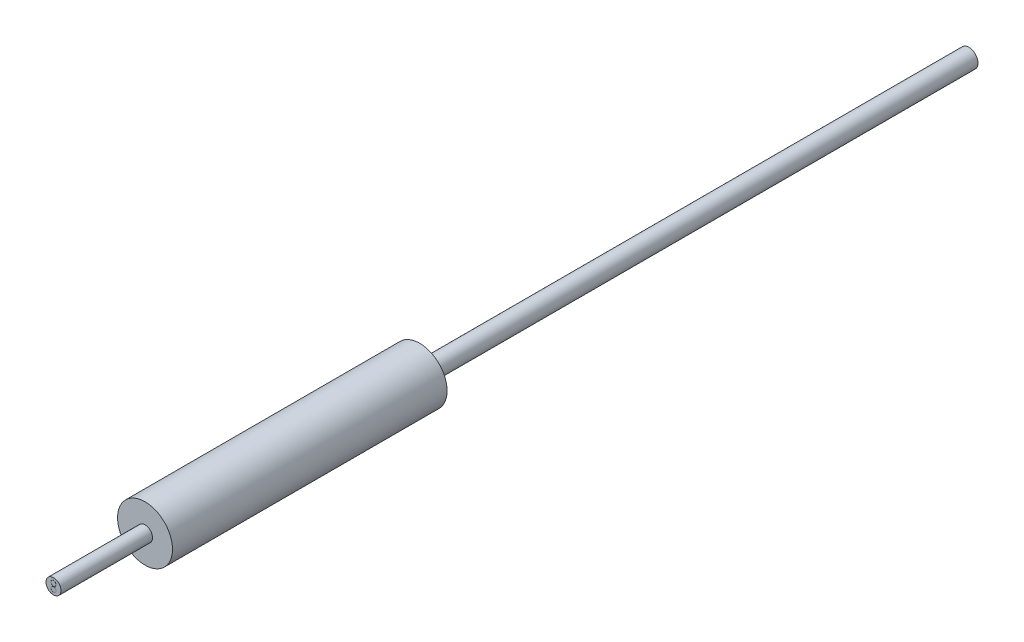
ISO-10303-21;
HEADER;
FILE_DESCRIPTION(('STEP AP214'),'2;1');
FILE_NAME('part.step','',(''),(''),'','','');
FILE_SCHEMA(('AUTOMOTIVE_DESIGN { 1 0 10303 214 1 1 1 1 }'));
ENDSEC;
DATA;
#1=APPLICATION_CONTEXT('core data for automotive mechanical design processes');
#2=APPLICATION_PROTOCOL_DEFINITION('international standard','automotive_design',2000,#1);
#3=PRODUCT_CONTEXT('',#1,'mechanical');
#4=PRODUCT('Part','Part','',(#3));
#5=PRODUCT_RELATED_PRODUCT_CATEGORY('part','',(#4));
#6=PRODUCT_DEFINITION_FORMATION('','',#4);
#7=PRODUCT_DEFINITION_CONTEXT('part definition',#1,'design');
#8=PRODUCT_DEFINITION('design','',#6,#7);
#9=PRODUCT_DEFINITION_SHAPE('','',#8);
#10=(LENGTH_UNIT() NAMED_UNIT(*) SI_UNIT(.MILLI.,.METRE.));
#11=(NAMED_UNIT(*) PLANE_ANGLE_UNIT() SI_UNIT($,.RADIAN.));
#12=(NAMED_UNIT(*) SI_UNIT($,.STERADIAN.) SOLID_ANGLE_UNIT());
#13=UNCERTAINTY_MEASURE_WITH_UNIT(LENGTH_MEASURE(1.E-05),#10,'distance_accuracy_value','');
#14=(GEOMETRIC_REPRESENTATION_CONTEXT(3) GLOBAL_UNCERTAINTY_ASSIGNED_CONTEXT((#13)) GLOBAL_UNIT_ASSIGNED_CONTEXT((#10,
#11,#12)) REPRESENTATION_CONTEXT('',''));
#15=CARTESIAN_POINT('',(0.,0.,0.));
#16=DIRECTION('',(0.,0.,1.));
#17=DIRECTION('',(1.,0.,0.));
#18=AXIS2_PLACEMENT_3D('',#15,#16,#17);
#19=CARTESIAN_POINT('',(0.,0.,-15.));
#20=DIRECTION('',(0.,0.,1.));
#21=DIRECTION('',(1.,0.,0.));
#22=AXIS2_PLACEMENT_3D('',#19,#20,#21);
#23=CYLINDRICAL_SURFACE('',#22,1.5);
#24=CARTESIAN_POINT('',(0.,0.,-15.));
#25=DIRECTION('',(0.,0.,1.));
#26=DIRECTION('',(1.,0.,0.));
#27=AXIS2_PLACEMENT_3D('',#24,#25,#26);
#28=CIRCLE('',#27,1.5);
#29=CARTESIAN_POINT('',(1.5,0.,-15.));
#30=VERTEX_POINT('',#29);
#31=EDGE_CURVE('E45',#30,#30,#28,.T.);
#32=ORIENTED_EDGE('',*,*,#31,.T.);
#33=EDGE_LOOP('',(#32));
#34=FACE_BOUND('',#33,.T.);
#35=CARTESIAN_POINT('',(0.,0.,0.));
#36=DIRECTION('',(0.,0.,1.));
#37=DIRECTION('',(1.,0.,0.));
#38=AXIS2_PLACEMENT_3D('',#35,#36,#37);
#39=CIRCLE('',#38,1.5);
#40=CARTESIAN_POINT('',(1.5,0.,0.));
#41=VERTEX_POINT('',#40);
#42=EDGE_CURVE('E36',#41,#41,#39,.T.);
#43=ORIENTED_EDGE('',*,*,#42,.F.);
#44=EDGE_LOOP('',(#43));
#45=FACE_BOUND('',#44,.T.);
#46=ADVANCED_FACE('F33',(#34,#45),#23,.T.);
#47=CARTESIAN_POINT('',(0.,0.,-15.));
#48=DIRECTION('',(0.,0.,1.));
#49=DIRECTION('',(1.,0.,0.));
#50=AXIS2_PLACEMENT_3D('',#47,#48,#49);
#51=PLANE('',#50);
#52=CARTESIAN_POINT('',(0.,0.,-15.));
#53=DIRECTION('',(0.,0.,-1.));
#54=DIRECTION('',(-1.,0.,0.));
#55=AXIS2_PLACEMENT_3D('',#52,#53,#54);
#56=CIRCLE('',#55,0.5);
#57=CARTESIAN_POINT('',(-0.5,0.,-15.));
#58=VERTEX_POINT('',#57);
#59=EDGE_CURVE('E40',#58,#58,#56,.T.);
#60=ORIENTED_EDGE('',*,*,#59,.F.);
#61=EDGE_LOOP('',(#60));
#62=FACE_BOUND('',#61,.T.);
#63=ORIENTED_EDGE('',*,*,#31,.F.);
#64=EDGE_LOOP('',(#63));
#65=FACE_BOUND('',#64,.T.);
#66=ADVANCED_FACE('F62',(#62,#65),#51,.F.);
#67=CARTESIAN_POINT('',(0.,0.,0.));
#68=DIRECTION('',(0.,0.,1.));
#69=DIRECTION('',(1.,0.,0.));
#70=AXIS2_PLACEMENT_3D('',#67,#68,#69);
#71=PLANE('',#70);
#72=CARTESIAN_POINT('',(0.,0.,0.));
#73=DIRECTION('',(0.,0.,1.));
#74=DIRECTION('',(1.,0.,0.));
#75=AXIS2_PLACEMENT_3D('',#72,#73,#74);
#76=CIRCLE('',#75,0.41);
#77=CARTESIAN_POINT('',(0.41,0.,0.));
#78=VERTEX_POINT('',#77);
#79=EDGE_CURVE('E10',#78,#78,#76,.T.);
#80=ORIENTED_EDGE('',*,*,#79,.F.);
#81=EDGE_LOOP('',(#80));
#82=FACE_BOUND('',#81,.T.);
#83=ORIENTED_EDGE('',*,*,#42,.T.);
#84=EDGE_LOOP('',(#83));
#85=FACE_BOUND('',#84,.T.);
#86=ADVANCED_FACE('F59',(#82,#85),#71,.T.);
#87=CARTESIAN_POINT('',(0.,0.,-45.));
#88=DIRECTION('',(0.,0.,1.));
#89=DIRECTION('',(1.,0.,0.));
#90=AXIS2_PLACEMENT_3D('',#87,#88,#89);
#91=CYLINDRICAL_SURFACE('',#90,0.5);
#92=CARTESIAN_POINT('',(0.,0.,-45.));
#93=DIRECTION('',(0.,0.,-1.));
#94=DIRECTION('',(-1.,0.,0.));
#95=AXIS2_PLACEMENT_3D('',#92,#93,#94);
#96=CIRCLE('',#95,0.5);
#97=CARTESIAN_POINT('',(-0.5,0.,-45.));
#98=VERTEX_POINT('',#97);
#99=EDGE_CURVE('E51',#98,#98,#96,.T.);
#100=ORIENTED_EDGE('',*,*,#99,.F.);
#101=EDGE_LOOP('',(#100));
#102=FACE_BOUND('',#101,.T.);
#103=ORIENTED_EDGE('',*,*,#59,.T.);
#104=EDGE_LOOP('',(#103));
#105=FACE_BOUND('',#104,.T.);
#106=ADVANCED_FACE('F71',(#102,#105),#91,.T.);
#107=CARTESIAN_POINT('',(0.,0.,-45.));
#108=DIRECTION('',(0.,0.,-1.));
#109=DIRECTION('',(-1.,0.,0.));
#110=AXIS2_PLACEMENT_3D('',#107,#108,#109);
#111=PLANE('',#110);
#112=ORIENTED_EDGE('',*,*,#99,.T.);
#113=EDGE_LOOP('',(#112));
#114=FACE_BOUND('',#113,.T.);
#115=ADVANCED_FACE('F78',(#114),#111,.T.);
#116=CARTESIAN_POINT('',(0.,0.,5.));
#117=DIRECTION('',(0.,0.,-1.));
#118=DIRECTION('',(-1.,0.,0.));
#119=AXIS2_PLACEMENT_3D('',#116,#117,#118);
#120=CYLINDRICAL_SURFACE('',#119,0.41);
#121=CARTESIAN_POINT('',(0.,0.,5.));
#122=DIRECTION('',(0.,0.,1.));
#123=DIRECTION('',(1.,0.,0.));
#124=AXIS2_PLACEMENT_3D('',#121,#122,#123);
#125=CIRCLE('',#124,0.41);
#126=CARTESIAN_POINT('',(0.41,0.,5.));
#127=VERTEX_POINT('',#126);
#128=EDGE_CURVE('E49',#127,#127,#125,.T.);
#129=ORIENTED_EDGE('',*,*,#128,.F.);
#130=EDGE_LOOP('',(#129));
#131=FACE_BOUND('',#130,.T.);
#132=ORIENTED_EDGE('',*,*,#79,.T.);
#133=EDGE_LOOP('',(#132));
#134=FACE_BOUND('',#133,.T.);
#135=ADVANCED_FACE('F82',(#131,#134),#120,.T.);
#136=CARTESIAN_POINT('',(0.,0.,5.));
#137=DIRECTION('',(0.,0.,1.));
#138=DIRECTION('',(1.,0.,0.));
#139=AXIS2_PLACEMENT_3D('',#136,#137,#138);
#140=PLANE('',#139);
#141=CARTESIAN_POINT('',(0.,-0.1475,5.));
#142=DIRECTION('',(0.,0.,1.));
#143=DIRECTION('',(1.,0.,0.));
#144=AXIS2_PLACEMENT_3D('',#141,#142,#143);
#145=CIRCLE('',#144,0.1375);
#146=CARTESIAN_POINT('',(0.1375,-0.1475,5.));
#147=VERTEX_POINT('',#146);
#148=EDGE_CURVE('E130',#147,#147,#145,.T.);
#149=ORIENTED_EDGE('',*,*,#148,.F.);
#150=EDGE_LOOP('',(#149));
#151=FACE_BOUND('',#150,.T.);
#152=CARTESIAN_POINT('',(0.,0.1475,5.));
#153=DIRECTION('',(0.,0.,1.));
#154=DIRECTION('',(1.,0.,0.));
#155=AXIS2_PLACEMENT_3D('',#152,#153,#154);
#156=CIRCLE('',#155,0.1375);
#157=CARTESIAN_POINT('',(0.1375,0.1475,5.));
#158=VERTEX_POINT('',#157);
#159=EDGE_CURVE('E133',#158,#158,#156,.T.);
#160=ORIENTED_EDGE('',*,*,#159,.F.);
#161=EDGE_LOOP('',(#160));
#162=FACE_BOUND('',#161,.T.);
#163=ORIENTED_EDGE('',*,*,#128,.T.);
#164=EDGE_LOOP('',(#163));
#165=FACE_BOUND('',#164,.T.);
#166=ADVANCED_FACE('F86',(#151,#162,#165),#140,.T.);
#167=CARTESIAN_POINT('',(0.,0.1475,4.9));
#168=DIRECTION('',(0.,0.,1.));
#169=DIRECTION('',(1.,0.,0.));
#170=AXIS2_PLACEMENT_3D('',#167,#168,#169);
#171=CYLINDRICAL_SURFACE('',#170,0.1375);
#172=CARTESIAN_POINT('',(0.,0.1475,4.9));
#173=DIRECTION('',(0.,0.,1.));
#174=DIRECTION('',(1.,0.,0.));
#175=AXIS2_PLACEMENT_3D('',#172,#173,#174);
#176=CIRCLE('',#175,0.1375);
#177=CARTESIAN_POINT('',(0.1375,0.1475,4.9));
#178=VERTEX_POINT('',#177);
#179=EDGE_CURVE('E128',#178,#178,#176,.T.);
#180=ORIENTED_EDGE('',*,*,#179,.F.);
#181=EDGE_LOOP('',(#180));
#182=FACE_BOUND('',#181,.T.);
#183=ORIENTED_EDGE('',*,*,#159,.T.);
#184=EDGE_LOOP('',(#183));
#185=FACE_BOUND('',#184,.T.);
#186=ADVANCED_FACE('F90',(#182,#185),#171,.F.);
#187=CARTESIAN_POINT('',(0.,0.1475,4.9));
#188=DIRECTION('',(0.,0.,1.));
#189=DIRECTION('',(1.,0.,0.));
#190=AXIS2_PLACEMENT_3D('',#187,#188,#189);
#191=PLANE('',#190);
#192=CARTESIAN_POINT('',(0.,0.1475,4.9));
#193=DIRECTION('',(0.,0.,1.));
#194=DIRECTION('',(1.,0.,0.));
#195=AXIS2_PLACEMENT_3D('',#192,#193,#194);
#196=CIRCLE('',#195,0.1325);
#197=CARTESIAN_POINT('',(0.1325,0.1475,4.9));
#198=VERTEX_POINT('',#197);
#199=EDGE_CURVE('E141',#198,#198,#196,.T.);
#200=ORIENTED_EDGE('',*,*,#199,.F.);
#201=EDGE_LOOP('',(#200));
#202=FACE_BOUND('',#201,.T.);
#203=ORIENTED_EDGE('',*,*,#179,.T.);
#204=EDGE_LOOP('',(#203));
#205=FACE_BOUND('',#204,.T.);
#206=ADVANCED_FACE('F96',(#202,#205),#191,.T.);
#207=CARTESIAN_POINT('',(0.,0.1475,4.9));
#208=DIRECTION('',(0.,0.,1.));
#209=DIRECTION('',(1.,0.,0.));
#210=AXIS2_PLACEMENT_3D('',#207,#208,#209);
#211=CYLINDRICAL_SURFACE('',#210,0.1325);
#212=ORIENTED_EDGE('',*,*,#199,.T.);
#213=EDGE_LOOP('',(#212));
#214=FACE_BOUND('',#213,.T.);
#215=CARTESIAN_POINT('',(0.,0.1475,5.));
#216=DIRECTION('',(0.,0.,1.));
#217=DIRECTION('',(1.,0.,0.));
#218=AXIS2_PLACEMENT_3D('',#215,#216,#217);
#219=CIRCLE('',#218,0.1325);
#220=CARTESIAN_POINT('',(0.1325,0.1475,5.));
#221=VERTEX_POINT('',#220);
#222=EDGE_CURVE('E144',#221,#221,#219,.T.);
#223=ORIENTED_EDGE('',*,*,#222,.F.);
#224=EDGE_LOOP('',(#223));
#225=FACE_BOUND('',#224,.T.);
#226=ADVANCED_FACE('F100',(#214,#225),#211,.T.);
#227=CARTESIAN_POINT('',(0.,-0.1475,4.9));
#228=DIRECTION('',(0.,0.,1.));
#229=DIRECTION('',(1.,0.,0.));
#230=AXIS2_PLACEMENT_3D('',#227,#228,#229);
#231=CYLINDRICAL_SURFACE('',#230,0.1375);
#232=CARTESIAN_POINT('',(0.,-0.1475,4.9));
#233=DIRECTION('',(0.,0.,1.));
#234=DIRECTION('',(1.,0.,0.));
#235=AXIS2_PLACEMENT_3D('',#232,#233,#234);
#236=CIRCLE('',#235,0.1375);
#237=CARTESIAN_POINT('',(0.1375,-0.1475,4.9));
#238=VERTEX_POINT('',#237);
#239=EDGE_CURVE('E136',#238,#238,#236,.T.);
#240=ORIENTED_EDGE('',*,*,#239,.F.);
#241=EDGE_LOOP('',(#240));
#242=FACE_BOUND('',#241,.T.);
#243=ORIENTED_EDGE('',*,*,#148,.T.);
#244=EDGE_LOOP('',(#243));
#245=FACE_BOUND('',#244,.T.);
#246=ADVANCED_FACE('F104',(#242,#245),#231,.F.);
#247=CARTESIAN_POINT('',(0.,-0.1475,4.9));
#248=DIRECTION('',(0.,0.,1.));
#249=DIRECTION('',(1.,0.,0.));
#250=AXIS2_PLACEMENT_3D('',#247,#248,#249);
#251=PLANE('',#250);
#252=CARTESIAN_POINT('',(0.,-0.1475,4.9));
#253=DIRECTION('',(0.,0.,1.));
#254=DIRECTION('',(1.,0.,0.));
#255=AXIS2_PLACEMENT_3D('',#252,#253,#254);
#256=CIRCLE('',#255,0.1325);
#257=CARTESIAN_POINT('',(0.1325,-0.1475,4.9));
#258=VERTEX_POINT('',#257);
#259=EDGE_CURVE('E123',#258,#258,#256,.T.);
#260=ORIENTED_EDGE('',*,*,#259,.F.);
#261=EDGE_LOOP('',(#260));
#262=FACE_BOUND('',#261,.T.);
#263=ORIENTED_EDGE('',*,*,#239,.T.);
#264=EDGE_LOOP('',(#263));
#265=FACE_BOUND('',#264,.T.);
#266=ADVANCED_FACE('F108',(#262,#265),#251,.T.);
#267=CARTESIAN_POINT('',(0.,-0.1475,4.9));
#268=DIRECTION('',(0.,0.,1.));
#269=DIRECTION('',(1.,0.,0.));
#270=AXIS2_PLACEMENT_3D('',#267,#268,#269);
#271=CYLINDRICAL_SURFACE('',#270,0.1325);
#272=ORIENTED_EDGE('',*,*,#259,.T.);
#273=EDGE_LOOP('',(#272));
#274=FACE_BOUND('',#273,.T.);
#275=CARTESIAN_POINT('',(0.,-0.1475,5.));
#276=DIRECTION('',(0.,0.,1.));
#277=DIRECTION('',(1.,0.,0.));
#278=AXIS2_PLACEMENT_3D('',#275,#276,#277);
#279=CIRCLE('',#278,0.1325);
#280=CARTESIAN_POINT('',(0.1325,-0.1475,5.));
#281=VERTEX_POINT('',#280);
#282=EDGE_CURVE('E126',#281,#281,#279,.T.);
#283=ORIENTED_EDGE('',*,*,#282,.F.);
#284=EDGE_LOOP('',(#283));
#285=FACE_BOUND('',#284,.T.);
#286=ADVANCED_FACE('F112',(#274,#285),#271,.T.);
#287=ORIENTED_EDGE('',*,*,#222,.T.);
#288=EDGE_LOOP('',(#287));
#289=FACE_BOUND('',#288,.T.);
#290=ADVANCED_FACE('F93',(#289),#140,.T.);
#291=ORIENTED_EDGE('',*,*,#282,.T.);
#292=EDGE_LOOP('',(#291));
#293=FACE_BOUND('',#292,.T.);
#294=ADVANCED_FACE('F92',(#293),#140,.T.);
#295=CLOSED_SHELL('',(#46,#66,#86,#106,#115,#135,#166,#186,#206,#226,#246,#266,#286,#290,#294));
#296=MANIFOLD_SOLID_BREP('B2',#295);
#297=ADVANCED_BREP_SHAPE_REPRESENTATION('',(#18,#296),#14);
#298=SHAPE_DEFINITION_REPRESENTATION(#9,#297);
ENDSEC;
END-ISO-10303-21;
